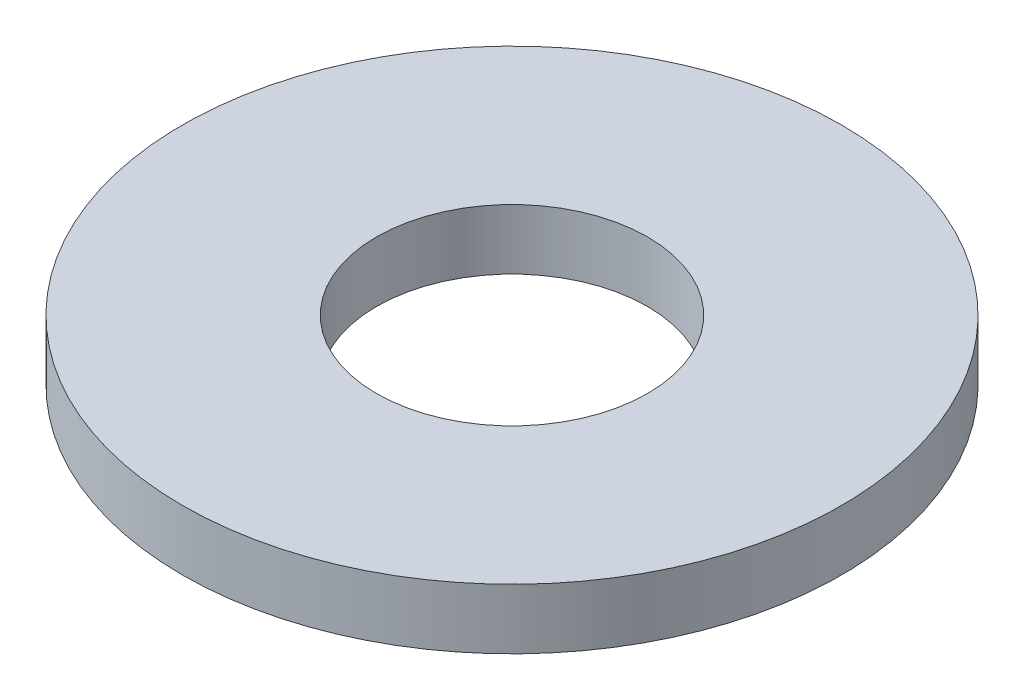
ISO-10303-21;
HEADER;
FILE_DESCRIPTION(('STEP AP214'),'2;1');
FILE_NAME('part.step','',(''),(''),'','','');
FILE_SCHEMA(('AUTOMOTIVE_DESIGN { 1 0 10303 214 1 1 1 1 }'));
ENDSEC;
DATA;
#1=APPLICATION_CONTEXT('core data for automotive mechanical design processes');
#2=APPLICATION_PROTOCOL_DEFINITION('international standard','automotive_design',2000,#1);
#3=PRODUCT_CONTEXT('',#1,'mechanical');
#4=PRODUCT('Part','Part','',(#3));
#5=PRODUCT_RELATED_PRODUCT_CATEGORY('part','',(#4));
#6=PRODUCT_DEFINITION_FORMATION('','',#4);
#7=PRODUCT_DEFINITION_CONTEXT('part definition',#1,'design');
#8=PRODUCT_DEFINITION('design','',#6,#7);
#9=PRODUCT_DEFINITION_SHAPE('','',#8);
#10=(LENGTH_UNIT() NAMED_UNIT(*) SI_UNIT(.MILLI.,.METRE.));
#11=(NAMED_UNIT(*) PLANE_ANGLE_UNIT() SI_UNIT($,.RADIAN.));
#12=(NAMED_UNIT(*) SI_UNIT($,.STERADIAN.) SOLID_ANGLE_UNIT());
#13=UNCERTAINTY_MEASURE_WITH_UNIT(LENGTH_MEASURE(1.E-05),#10,'distance_accuracy_value','');
#14=(GEOMETRIC_REPRESENTATION_CONTEXT(3) GLOBAL_UNCERTAINTY_ASSIGNED_CONTEXT((#13)) GLOBAL_UNIT_ASSIGNED_CONTEXT((#10,
#11,#12)) REPRESENTATION_CONTEXT('',''));
#15=CARTESIAN_POINT('',(0.,0.,0.));
#16=DIRECTION('',(0.,0.,1.));
#17=DIRECTION('',(1.,0.,0.));
#18=AXIS2_PLACEMENT_3D('',#15,#16,#17);
#19=CARTESIAN_POINT('',(-8.88178419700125E-13,1.01599999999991,0.));
#20=DIRECTION('',(0.,1.,0.));
#21=DIRECTION('',(0.,0.,1.));
#22=AXIS2_PLACEMENT_3D('',#19,#20,#21);
#23=PLANE('',#22);
#24=CARTESIAN_POINT('',(-8.88178419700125E-13,1.01599999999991,0.));
#25=DIRECTION('',(0.,1.,0.));
#26=DIRECTION('',(0.,0.,1.));
#27=AXIS2_PLACEMENT_3D('',#24,#25,#26);
#28=CIRCLE('',#27,5.55625);
#29=CARTESIAN_POINT('',(-8.83243478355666E-13,1.01599999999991,5.55625000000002));
#30=VERTEX_POINT('',#29);
#31=EDGE_CURVE('E10',#30,#30,#28,.T.);
#32=ORIENTED_EDGE('',*,*,#31,.T.);
#33=EDGE_LOOP('',(#32));
#34=FACE_BOUND('',#33,.T.);
#35=CARTESIAN_POINT('',(-8.88178419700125E-13,1.01599999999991,0.));
#36=DIRECTION('',(0.,1.,0.));
#37=DIRECTION('',(0.,0.,1.));
#38=AXIS2_PLACEMENT_3D('',#35,#36,#37);
#39=CIRCLE('',#38,2.286);
#40=CARTESIAN_POINT('',(-8.86148043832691E-13,1.01599999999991,2.28600000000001));
#41=VERTEX_POINT('',#40);
#42=EDGE_CURVE('E43',#41,#41,#39,.T.);
#43=ORIENTED_EDGE('',*,*,#42,.F.);
#44=EDGE_LOOP('',(#43));
#45=FACE_BOUND('',#44,.T.);
#46=ADVANCED_FACE('F32',(#34,#45),#23,.T.);
#47=CARTESIAN_POINT('',(0.,0.,0.));
#48=DIRECTION('',(0.,1.,0.));
#49=DIRECTION('',(0.,0.,1.));
#50=AXIS2_PLACEMENT_3D('',#47,#48,#49);
#51=PLANE('',#50);
#52=CARTESIAN_POINT('',(0.,0.,0.));
#53=DIRECTION('',(0.,1.,0.));
#54=DIRECTION('',(0.,0.,1.));
#55=AXIS2_PLACEMENT_3D('',#52,#53,#54);
#56=CIRCLE('',#55,5.55625);
#57=CARTESIAN_POINT('',(0.,0.,5.55625000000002));
#58=VERTEX_POINT('',#57);
#59=EDGE_CURVE('E36',#58,#58,#56,.T.);
#60=ORIENTED_EDGE('',*,*,#59,.F.);
#61=EDGE_LOOP('',(#60));
#62=FACE_BOUND('',#61,.T.);
#63=CARTESIAN_POINT('',(0.,0.,0.));
#64=DIRECTION('',(0.,1.,0.));
#65=DIRECTION('',(0.,0.,1.));
#66=AXIS2_PLACEMENT_3D('',#63,#64,#65);
#67=CIRCLE('',#66,2.286);
#68=CARTESIAN_POINT('',(0.,0.,2.28600000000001));
#69=VERTEX_POINT('',#68);
#70=EDGE_CURVE('E45',#69,#69,#67,.T.);
#71=ORIENTED_EDGE('',*,*,#70,.T.);
#72=EDGE_LOOP('',(#71));
#73=FACE_BOUND('',#72,.T.);
#74=ADVANCED_FACE('F55',(#62,#73),#51,.F.);
#75=CARTESIAN_POINT('',(-8.88178419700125E-13,1.01599999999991,0.));
#76=DIRECTION('',(0.,-1.,0.));
#77=DIRECTION('',(0.,0.,-1.));
#78=AXIS2_PLACEMENT_3D('',#75,#76,#77);
#79=CYLINDRICAL_SURFACE('',#78,5.55625);
#80=ORIENTED_EDGE('',*,*,#31,.F.);
#81=EDGE_LOOP('',(#80));
#82=FACE_BOUND('',#81,.T.);
#83=ORIENTED_EDGE('',*,*,#59,.T.);
#84=EDGE_LOOP('',(#83));
#85=FACE_BOUND('',#84,.T.);
#86=ADVANCED_FACE('F34',(#82,#85),#79,.T.);
#87=CARTESIAN_POINT('',(-8.88178419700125E-13,1.01599999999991,0.));
#88=DIRECTION('',(0.,-1.,0.));
#89=DIRECTION('',(0.,0.,-1.));
#90=AXIS2_PLACEMENT_3D('',#87,#88,#89);
#91=CYLINDRICAL_SURFACE('',#90,2.286);
#92=ORIENTED_EDGE('',*,*,#42,.T.);
#93=EDGE_LOOP('',(#92));
#94=FACE_BOUND('',#93,.T.);
#95=ORIENTED_EDGE('',*,*,#70,.F.);
#96=EDGE_LOOP('',(#95));
#97=FACE_BOUND('',#96,.T.);
#98=ADVANCED_FACE('F51',(#94,#97),#91,.F.);
#99=CLOSED_SHELL('',(#46,#74,#86,#98));
#100=MANIFOLD_SOLID_BREP('B2',#99);
#101=ADVANCED_BREP_SHAPE_REPRESENTATION('',(#18,#100),#14);
#102=SHAPE_DEFINITION_REPRESENTATION(#9,#101);
ENDSEC;
END-ISO-10303-21;
